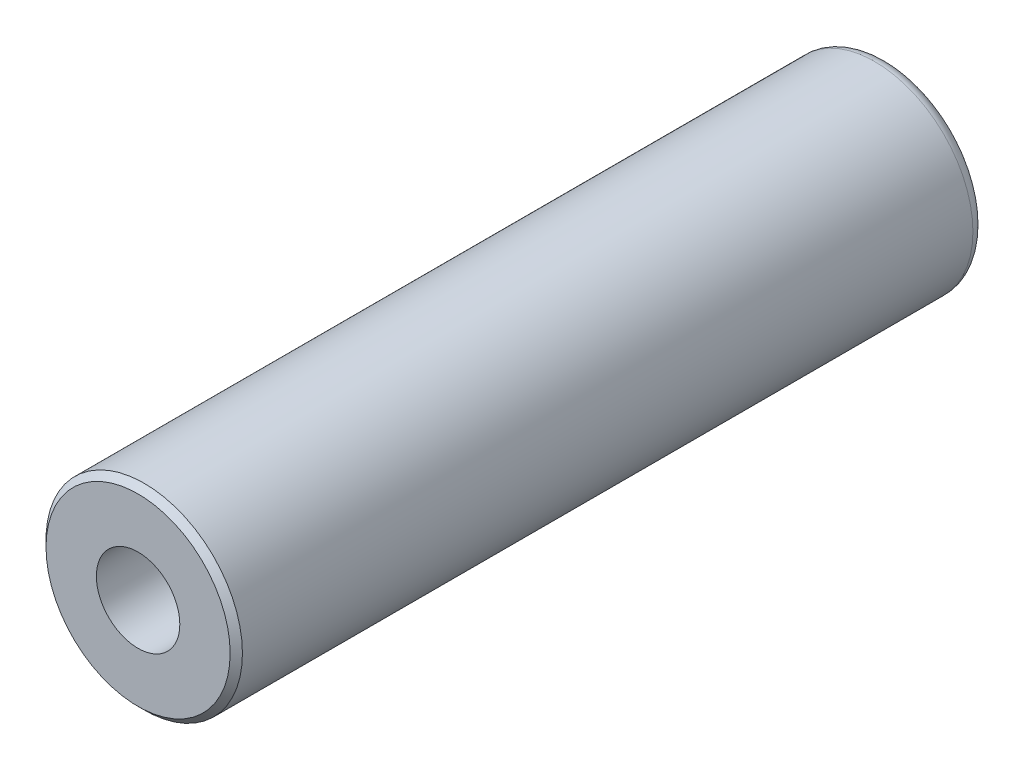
from build123d import *

# Parameters (mm, degrees)
ESQUISSE1_R          = 8
BASE_EXTRUSION_DEPTH = 61
CONG_1_R             = 1
CHANFREIN1_SIZE      = 0.5
PER_AGE1_D           = 6.8
PER_AGE1_DEPTH       = 20
PER_AGE1_TIP         = 2.042926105


with BuildPart() as part:
    # Esquisse1 → Base-Extrusion (new body)
    with BuildSketch(Plane.XY):
        Circle(ESQUISSE1_R)
    extrude(amount=BASE_EXTRUSION_DEPTH)

    # Cong_1
    cong_1_edges = [part.edges().sort_by_distance(p)[0] for p in [
        (-8, 0, 0),
    ]]
    fillet(cong_1_edges, radius=CONG_1_R)

    # Chanfrein1
    chanfrein1_edges = [part.edges().sort_by_distance(p)[0] for p in [
        (-8, 0, 61),
    ]]
    chamfer(chanfrein1_edges, length=CHANFREIN1_SIZE)

    # Per_age1
    with Locations(Plane.XY.offset(61)):
        with Locations((0, 0)):
            Hole(PER_AGE1_D / 2, depth=PER_AGE1_DEPTH)
            with Locations((0, 0, -(PER_AGE1_DEPTH + PER_AGE1_TIP / 2))):  # 118° drill point
                Cone(0, PER_AGE1_D / 2, PER_AGE1_TIP, mode=Mode.SUBTRACT)


solid = part.part
